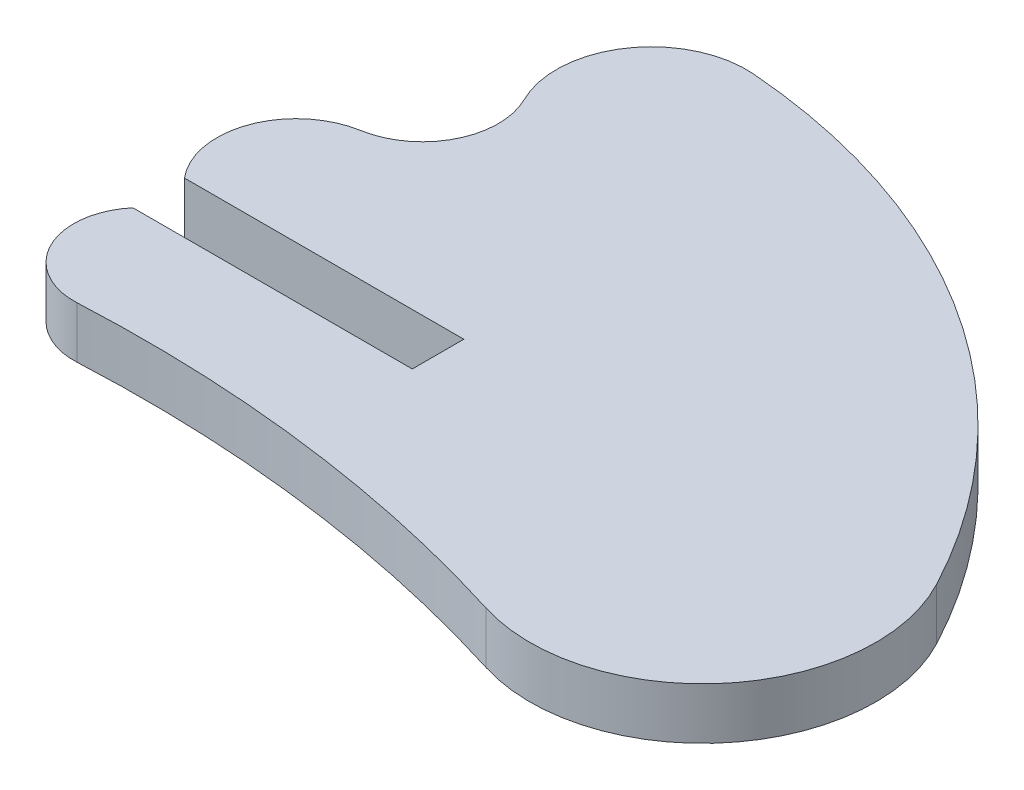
ISO-10303-21;
HEADER;
FILE_DESCRIPTION(('STEP AP214'),'2;1');
FILE_NAME('part.step','',(''),(''),'','','');
FILE_SCHEMA(('AUTOMOTIVE_DESIGN { 1 0 10303 214 1 1 1 1 }'));
ENDSEC;
DATA;
#1=APPLICATION_CONTEXT('core data for automotive mechanical design processes');
#2=APPLICATION_PROTOCOL_DEFINITION('international standard','automotive_design',2000,#1);
#3=PRODUCT_CONTEXT('',#1,'mechanical');
#4=PRODUCT('Part','Part','',(#3));
#5=PRODUCT_RELATED_PRODUCT_CATEGORY('part','',(#4));
#6=PRODUCT_DEFINITION_FORMATION('','',#4);
#7=PRODUCT_DEFINITION_CONTEXT('part definition',#1,'design');
#8=PRODUCT_DEFINITION('design','',#6,#7);
#9=PRODUCT_DEFINITION_SHAPE('','',#8);
#10=(LENGTH_UNIT() NAMED_UNIT(*) SI_UNIT(.MILLI.,.METRE.));
#11=(NAMED_UNIT(*) PLANE_ANGLE_UNIT() SI_UNIT($,.RADIAN.));
#12=(NAMED_UNIT(*) SI_UNIT($,.STERADIAN.) SOLID_ANGLE_UNIT());
#13=UNCERTAINTY_MEASURE_WITH_UNIT(LENGTH_MEASURE(1.E-05),#10,'distance_accuracy_value','');
#14=(GEOMETRIC_REPRESENTATION_CONTEXT(3) GLOBAL_UNCERTAINTY_ASSIGNED_CONTEXT((#13)) GLOBAL_UNIT_ASSIGNED_CONTEXT((#10,
#11,#12)) REPRESENTATION_CONTEXT('',''));
#15=CARTESIAN_POINT('',(0.,0.,0.));
#16=DIRECTION('',(0.,0.,1.));
#17=DIRECTION('',(1.,0.,0.));
#18=AXIS2_PLACEMENT_3D('',#15,#16,#17);
#19=CARTESIAN_POINT('',(-41817.0317918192,3.,-18208.9563791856));
#20=DIRECTION('',(0.,-1.,0.));
#21=DIRECTION('',(0.,0.,-1.));
#22=AXIS2_PLACEMENT_3D('',#19,#20,#21);
#23=CYLINDRICAL_SURFACE('',#22,10.0652598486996);
#24=CARTESIAN_POINT('',(-41817.0317918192,0.,-18208.9563791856));
#25=DIRECTION('',(0.,1.,0.));
#26=DIRECTION('',(0.,0.,1.));
#27=AXIS2_PLACEMENT_3D('',#24,#25,#26);
#28=CIRCLE('',#27,10.0652598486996);
#29=CARTESIAN_POINT('',(-41820.040166,0.,-18199.3512170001));
#30=VERTEX_POINT('',#29);
#31=CARTESIAN_POINT('',(-41808.137642,0.,-18213.668444));
#32=VERTEX_POINT('',#31);
#33=EDGE_CURVE('E144',#30,#32,#28,.T.);
#34=ORIENTED_EDGE('',*,*,#33,.T.);
#35=DIRECTION('',(0.,-1.,0.));
#36=VECTOR('',#35,1.);
#37=CARTESIAN_POINT('',(-41808.137642,3.,-18213.668444));
#38=LINE('',#37,#36);
#39=CARTESIAN_POINT('',(-41808.137642,3.,-18213.668444));
#40=VERTEX_POINT('',#39);
#41=EDGE_CURVE('E11',#40,#32,#38,.T.);
#42=ORIENTED_EDGE('',*,*,#41,.F.);
#43=CARTESIAN_POINT('',(-41817.0317918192,3.,-18208.9563791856));
#44=DIRECTION('',(0.,1.,0.));
#45=DIRECTION('',(0.,0.,1.));
#46=AXIS2_PLACEMENT_3D('',#43,#44,#45);
#47=CIRCLE('',#46,10.0652598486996);
#48=CARTESIAN_POINT('',(-41820.040166,3.,-18199.3512170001));
#49=VERTEX_POINT('',#48);
#50=EDGE_CURVE('E162',#49,#40,#47,.T.);
#51=ORIENTED_EDGE('',*,*,#50,.F.);
#52=DIRECTION('',(0.,-1.,0.));
#53=VECTOR('',#52,1.);
#54=CARTESIAN_POINT('',(-41820.040166,3.,-18199.3512170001));
#55=LINE('',#54,#53);
#56=EDGE_CURVE('E140',#49,#30,#55,.T.);
#57=ORIENTED_EDGE('',*,*,#56,.T.);
#58=EDGE_LOOP('',(#34,#42,#51,#57));
#59=FACE_BOUND('',#58,.T.);
#60=ADVANCED_FACE('F36',(#59),#23,.T.);
#61=CARTESIAN_POINT('',(-41842.1884395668,3.,-18195.6353827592));
#62=DIRECTION('',(0.,-1.,0.));
#63=DIRECTION('',(0.,0.,-1.));
#64=AXIS2_PLACEMENT_3D('',#61,#62,#63);
#65=CYLINDRICAL_SURFACE('',#64,38.5311317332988);
#66=CARTESIAN_POINT('',(-41842.1884395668,0.,-18195.6353827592));
#67=DIRECTION('',(0.,1.,0.));
#68=DIRECTION('',(0.,0.,1.));
#69=AXIS2_PLACEMENT_3D('',#66,#67,#68);
#70=CIRCLE('',#69,38.5311317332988);
#71=CARTESIAN_POINT('',(-41839.185761,0.,-18234.0493390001));
#72=VERTEX_POINT('',#71);
#73=EDGE_CURVE('E147',#32,#72,#70,.T.);
#74=ORIENTED_EDGE('',*,*,#73,.T.);
#75=DIRECTION('',(0.,-1.,0.));
#76=VECTOR('',#75,1.);
#77=CARTESIAN_POINT('',(-41839.185761,3.,-18234.0493390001));
#78=LINE('',#77,#76);
#79=CARTESIAN_POINT('',(-41839.185761,3.,-18234.0493390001));
#80=VERTEX_POINT('',#79);
#81=EDGE_CURVE('E44',#80,#72,#78,.T.);
#82=ORIENTED_EDGE('',*,*,#81,.F.);
#83=CARTESIAN_POINT('',(-41842.1884395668,3.,-18195.6353827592));
#84=DIRECTION('',(0.,1.,0.));
#85=DIRECTION('',(0.,0.,1.));
#86=AXIS2_PLACEMENT_3D('',#83,#84,#85);
#87=CIRCLE('',#86,38.5311317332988);
#88=EDGE_CURVE('E101',#40,#80,#87,.T.);
#89=ORIENTED_EDGE('',*,*,#88,.F.);
#90=ORIENTED_EDGE('',*,*,#41,.T.);
#91=EDGE_LOOP('',(#74,#82,#89,#90));
#92=FACE_BOUND('',#91,.T.);
#93=ADVANCED_FACE('F211',(#92),#65,.T.);
#94=CARTESIAN_POINT('',(-41839.6167840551,3.,-18228.5455191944));
#95=DIRECTION('',(0.,-1.,0.));
#96=DIRECTION('',(0.,0.,-1.));
#97=AXIS2_PLACEMENT_3D('',#94,#95,#96);
#98=CYLINDRICAL_SURFACE('',#97,5.52067145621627);
#99=CARTESIAN_POINT('',(-41839.6167840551,0.,-18228.5455191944));
#100=DIRECTION('',(0.,1.,0.));
#101=DIRECTION('',(0.,0.,1.));
#102=AXIS2_PLACEMENT_3D('',#99,#100,#101);
#103=CIRCLE('',#102,5.52067145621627);
#104=CARTESIAN_POINT('',(-41844.559122,0.,-18226.085619));
#105=VERTEX_POINT('',#104);
#106=EDGE_CURVE('E149',#72,#105,#103,.T.);
#107=ORIENTED_EDGE('',*,*,#106,.T.);
#108=DIRECTION('',(0.,-1.,0.));
#109=VECTOR('',#108,1.);
#110=CARTESIAN_POINT('',(-41844.559122,3.,-18226.085619));
#111=LINE('',#110,#109);
#112=CARTESIAN_POINT('',(-41844.559122,3.,-18226.085619));
#113=VERTEX_POINT('',#112);
#114=EDGE_CURVE('E175',#113,#105,#111,.T.);
#115=ORIENTED_EDGE('',*,*,#114,.F.);
#116=CARTESIAN_POINT('',(-41839.6167840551,3.,-18228.5455191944));
#117=DIRECTION('',(0.,1.,0.));
#118=DIRECTION('',(0.,0.,1.));
#119=AXIS2_PLACEMENT_3D('',#116,#117,#118);
#120=CIRCLE('',#119,5.52067145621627);
#121=EDGE_CURVE('E183',#80,#113,#120,.T.);
#122=ORIENTED_EDGE('',*,*,#121,.F.);
#123=ORIENTED_EDGE('',*,*,#81,.T.);
#124=EDGE_LOOP('',(#107,#115,#122,#123));
#125=FACE_BOUND('',#124,.T.);
#126=ADVANCED_FACE('F181',(#125),#98,.T.);
#127=CARTESIAN_POINT('',(-41848.5079255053,3.,-18224.1189168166));
#128=DIRECTION('',(0.,-1.,0.));
#129=DIRECTION('',(0.,0.,-1.));
#130=AXIS2_PLACEMENT_3D('',#127,#128,#129);
#131=CYLINDRICAL_SURFACE('',#130,4.41145855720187);
#132=CARTESIAN_POINT('',(-41848.5079255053,0.,-18224.1189168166));
#133=DIRECTION('',(0.,-1.,0.));
#134=DIRECTION('',(0.,0.,1.));
#135=AXIS2_PLACEMENT_3D('',#132,#133,#134);
#136=CIRCLE('',#135,4.41145855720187);
#137=CARTESIAN_POINT('',(-41847.755704,0.,-18219.772064));
#138=VERTEX_POINT('',#137);
#139=EDGE_CURVE('E151',#105,#138,#136,.T.);
#140=ORIENTED_EDGE('',*,*,#139,.T.);
#141=DIRECTION('',(0.,-1.,0.));
#142=VECTOR('',#141,1.);
#143=CARTESIAN_POINT('',(-41847.755704,3.,-18219.772064));
#144=LINE('',#143,#142);
#145=CARTESIAN_POINT('',(-41847.755704,3.,-18219.772064));
#146=VERTEX_POINT('',#145);
#147=EDGE_CURVE('E172',#146,#138,#144,.T.);
#148=ORIENTED_EDGE('',*,*,#147,.F.);
#149=CARTESIAN_POINT('',(-41848.5079255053,3.,-18224.1189168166));
#150=DIRECTION('',(0.,-1.,0.));
#151=DIRECTION('',(0.,0.,1.));
#152=AXIS2_PLACEMENT_3D('',#149,#150,#151);
#153=CIRCLE('',#152,4.41145855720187);
#154=EDGE_CURVE('E201',#113,#146,#153,.T.);
#155=ORIENTED_EDGE('',*,*,#154,.F.);
#156=ORIENTED_EDGE('',*,*,#114,.T.);
#157=EDGE_LOOP('',(#140,#148,#155,#156));
#158=FACE_BOUND('',#157,.T.);
#159=ADVANCED_FACE('F192',(#158),#131,.F.);
#160=CARTESIAN_POINT('',(-41846.9736069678,3.,-18215.2298035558));
#161=DIRECTION('',(0.,-1.,0.));
#162=DIRECTION('',(0.,0.,-1.));
#163=AXIS2_PLACEMENT_3D('',#160,#161,#162);
#164=CYLINDRICAL_SURFACE('',#163,4.60910031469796);
#165=CARTESIAN_POINT('',(-41846.9736069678,0.,-18215.2298035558));
#166=DIRECTION('',(0.,1.,0.));
#167=DIRECTION('',(0.,0.,1.));
#168=AXIS2_PLACEMENT_3D('',#165,#166,#167);
#169=CIRCLE('',#168,4.60910031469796);
#170=CARTESIAN_POINT('',(-41850.488281,0.,-18212.248047));
#171=VERTEX_POINT('',#170);
#172=EDGE_CURVE('E153',#138,#171,#169,.T.);
#173=ORIENTED_EDGE('',*,*,#172,.T.);
#174=DIRECTION('',(0.,-1.,0.));
#175=VECTOR('',#174,1.);
#176=CARTESIAN_POINT('',(-41850.488281,3.,-18212.248047));
#177=LINE('',#176,#175);
#178=CARTESIAN_POINT('',(-41850.488281,3.,-18212.248047));
#179=VERTEX_POINT('',#178);
#180=EDGE_CURVE('E169',#179,#171,#177,.T.);
#181=ORIENTED_EDGE('',*,*,#180,.F.);
#182=CARTESIAN_POINT('',(-41846.9736069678,3.,-18215.2298035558));
#183=DIRECTION('',(0.,1.,0.));
#184=DIRECTION('',(0.,0.,1.));
#185=AXIS2_PLACEMENT_3D('',#182,#183,#184);
#186=CIRCLE('',#185,4.60910031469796);
#187=EDGE_CURVE('E198',#146,#179,#186,.T.);
#188=ORIENTED_EDGE('',*,*,#187,.F.);
#189=ORIENTED_EDGE('',*,*,#147,.T.);
#190=EDGE_LOOP('',(#173,#181,#188,#189));
#191=FACE_BOUND('',#190,.T.);
#192=ADVANCED_FACE('F196',(#191),#164,.T.);
#193=CARTESIAN_POINT('',(-41834.238281,3.,-18212.251953));
#194=DIRECTION('',(-0.00024036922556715,0.,-0.999999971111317));
#195=DIRECTION('',(-0.999999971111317,0.,0.00024036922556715));
#196=AXIS2_PLACEMENT_3D('',#193,#194,#195);
#197=PLANE('',#196);
#198=DIRECTION('',(0.999999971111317,0.,-0.000240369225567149));
#199=VECTOR('',#198,1.);
#200=CARTESIAN_POINT('',(-41834.238281,0.,-18212.251953));
#201=LINE('',#200,#199);
#202=CARTESIAN_POINT('',(-41834.238281,0.,-18212.251953));
#203=VERTEX_POINT('',#202);
#204=EDGE_CURVE('E155',#171,#203,#201,.T.);
#205=ORIENTED_EDGE('',*,*,#204,.T.);
#206=DIRECTION('',(0.,-1.,0.));
#207=VECTOR('',#206,1.);
#208=CARTESIAN_POINT('',(-41834.238281,3.,-18212.251953));
#209=LINE('',#208,#207);
#210=CARTESIAN_POINT('',(-41834.238281,3.,-18212.251953));
#211=VERTEX_POINT('',#210);
#212=EDGE_CURVE('E166',#211,#203,#209,.T.);
#213=ORIENTED_EDGE('',*,*,#212,.F.);
#214=DIRECTION('',(0.999999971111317,0.,-0.000240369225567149));
#215=VECTOR('',#214,1.);
#216=CARTESIAN_POINT('',(-41834.238281,3.,-18212.251953));
#217=LINE('',#216,#215);
#218=EDGE_CURVE('E200',#179,#211,#217,.T.);
#219=ORIENTED_EDGE('',*,*,#218,.F.);
#220=ORIENTED_EDGE('',*,*,#180,.T.);
#221=EDGE_LOOP('',(#205,#213,#219,#220));
#222=FACE_BOUND('',#221,.T.);
#223=ADVANCED_FACE('F223',(#222),#197,.F.);
#224=CARTESIAN_POINT('',(-41834.238281,3.,-18209.253906));
#225=DIRECTION('',(1.,0.,0.));
#226=DIRECTION('',(0.,0.,-1.));
#227=AXIS2_PLACEMENT_3D('',#224,#225,#226);
#228=PLANE('',#227);
#229=DIRECTION('',(0.,0.,1.));
#230=VECTOR('',#229,1.);
#231=CARTESIAN_POINT('',(-41834.238281,0.,-18209.253906));
#232=LINE('',#231,#230);
#233=CARTESIAN_POINT('',(-41834.238281,0.,-18209.253906));
#234=VERTEX_POINT('',#233);
#235=EDGE_CURVE('E157',#203,#234,#232,.T.);
#236=ORIENTED_EDGE('',*,*,#235,.T.);
#237=DIRECTION('',(0.,-1.,0.));
#238=VECTOR('',#237,1.);
#239=CARTESIAN_POINT('',(-41834.238281,3.,-18209.253906));
#240=LINE('',#239,#238);
#241=CARTESIAN_POINT('',(-41834.238281,3.,-18209.253906));
#242=VERTEX_POINT('',#241);
#243=EDGE_CURVE('E135',#242,#234,#240,.T.);
#244=ORIENTED_EDGE('',*,*,#243,.F.);
#245=DIRECTION('',(0.,0.,1.));
#246=VECTOR('',#245,1.);
#247=CARTESIAN_POINT('',(-41834.238281,3.,-18209.253906));
#248=LINE('',#247,#246);
#249=EDGE_CURVE('E126',#211,#242,#248,.T.);
#250=ORIENTED_EDGE('',*,*,#249,.F.);
#251=ORIENTED_EDGE('',*,*,#212,.T.);
#252=EDGE_LOOP('',(#236,#244,#250,#251));
#253=FACE_BOUND('',#252,.T.);
#254=ADVANCED_FACE('F226',(#253),#228,.F.);
#255=CARTESIAN_POINT('',(-41850.486809,3.,-18209.248787));
#256=DIRECTION('',(0.000315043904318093,0.,0.999999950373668));
#257=DIRECTION('',(0.999999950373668,0.,-0.000315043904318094));
#258=AXIS2_PLACEMENT_3D('',#255,#256,#257);
#259=PLANE('',#258);
#260=DIRECTION('',(-0.999999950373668,0.,0.000315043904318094));
#261=VECTOR('',#260,1.);
#262=CARTESIAN_POINT('',(-41850.486809,0.,-18209.248787));
#263=LINE('',#262,#261);
#264=CARTESIAN_POINT('',(-41850.486809,0.,-18209.248787));
#265=VERTEX_POINT('',#264);
#266=EDGE_CURVE('E134',#234,#265,#263,.T.);
#267=ORIENTED_EDGE('',*,*,#266,.T.);
#268=DIRECTION('',(0.,-1.,0.));
#269=VECTOR('',#268,1.);
#270=CARTESIAN_POINT('',(-41850.486809,3.,-18209.248787));
#271=LINE('',#270,#269);
#272=CARTESIAN_POINT('',(-41850.486809,3.,-18209.248787));
#273=VERTEX_POINT('',#272);
#274=EDGE_CURVE('E131',#273,#265,#271,.T.);
#275=ORIENTED_EDGE('',*,*,#274,.F.);
#276=DIRECTION('',(-0.999999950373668,0.,0.000315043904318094));
#277=VECTOR('',#276,1.);
#278=CARTESIAN_POINT('',(-41850.486809,3.,-18209.248787));
#279=LINE('',#278,#277);
#280=EDGE_CURVE('E120',#242,#273,#279,.T.);
#281=ORIENTED_EDGE('',*,*,#280,.F.);
#282=ORIENTED_EDGE('',*,*,#243,.T.);
#283=EDGE_LOOP('',(#267,#275,#281,#282));
#284=FACE_BOUND('',#283,.T.);
#285=ADVANCED_FACE('F132',(#284),#259,.F.);
#286=CARTESIAN_POINT('',(-41847.5194658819,3.,-18206.7264299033));
#287=DIRECTION('',(0.,-1.,0.));
#288=DIRECTION('',(0.,0.,-1.));
#289=AXIS2_PLACEMENT_3D('',#286,#287,#288);
#290=CYLINDRICAL_SURFACE('',#289,3.89453598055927);
#291=CARTESIAN_POINT('',(-41847.5194658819,0.,-18206.7264299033));
#292=DIRECTION('',(0.,1.,0.));
#293=DIRECTION('',(0.,0.,1.));
#294=AXIS2_PLACEMENT_3D('',#291,#292,#293);
#295=CIRCLE('',#294,3.89453598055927);
#296=CARTESIAN_POINT('',(-41847.325924,0.,-18202.8367060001));
#297=VERTEX_POINT('',#296);
#298=EDGE_CURVE('E87',#265,#297,#295,.T.);
#299=ORIENTED_EDGE('',*,*,#298,.T.);
#300=DIRECTION('',(0.,-1.,0.));
#301=VECTOR('',#300,1.);
#302=CARTESIAN_POINT('',(-41847.325924,3.,-18202.8367060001));
#303=LINE('',#302,#301);
#304=CARTESIAN_POINT('',(-41847.325924,3.,-18202.8367060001));
#305=VERTEX_POINT('',#304);
#306=EDGE_CURVE('E136',#305,#297,#303,.T.);
#307=ORIENTED_EDGE('',*,*,#306,.F.);
#308=CARTESIAN_POINT('',(-41847.5194658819,3.,-18206.7264299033));
#309=DIRECTION('',(0.,1.,0.));
#310=DIRECTION('',(0.,0.,1.));
#311=AXIS2_PLACEMENT_3D('',#308,#309,#310);
#312=CIRCLE('',#311,3.89453598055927);
#313=EDGE_CURVE('E124',#273,#305,#312,.T.);
#314=ORIENTED_EDGE('',*,*,#313,.F.);
#315=ORIENTED_EDGE('',*,*,#274,.T.);
#316=EDGE_LOOP('',(#299,#307,#314,#315));
#317=FACE_BOUND('',#316,.T.);
#318=ADVANCED_FACE('F138',(#317),#290,.T.);
#319=CARTESIAN_POINT('',(-41843.460937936,3.,-18124.5488281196));
#320=DIRECTION('',(0.,-1.,0.));
#321=DIRECTION('',(0.,0.,-1.));
#322=AXIS2_PLACEMENT_3D('',#319,#320,#321);
#323=CYLINDRICAL_SURFACE('',#322,78.3832248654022);
#324=CARTESIAN_POINT('',(-41843.460937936,0.,-18124.5488281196));
#325=DIRECTION('',(0.,-1.,0.));
#326=DIRECTION('',(0.,0.,1.));
#327=AXIS2_PLACEMENT_3D('',#324,#325,#326);
#328=CIRCLE('',#327,78.3832248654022);
#329=EDGE_CURVE('E93',#297,#30,#328,.T.);
#330=ORIENTED_EDGE('',*,*,#329,.T.);
#331=ORIENTED_EDGE('',*,*,#56,.F.);
#332=CARTESIAN_POINT('',(-41843.460937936,3.,-18124.5488281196));
#333=DIRECTION('',(0.,-1.,0.));
#334=DIRECTION('',(0.,0.,1.));
#335=AXIS2_PLACEMENT_3D('',#332,#333,#334);
#336=CIRCLE('',#335,78.3832248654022);
#337=EDGE_CURVE('E52',#305,#49,#336,.T.);
#338=ORIENTED_EDGE('',*,*,#337,.F.);
#339=ORIENTED_EDGE('',*,*,#306,.T.);
#340=EDGE_LOOP('',(#330,#331,#338,#339));
#341=FACE_BOUND('',#340,.T.);
#342=ADVANCED_FACE('F235',(#341),#323,.F.);
#343=CARTESIAN_POINT('',(-41817.0317918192,3.,-18208.9563791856));
#344=DIRECTION('',(0.,1.,0.));
#345=DIRECTION('',(0.,0.,1.));
#346=AXIS2_PLACEMENT_3D('',#343,#344,#345);
#347=PLANE('',#346);
#348=ORIENTED_EDGE('',*,*,#50,.T.);
#349=ORIENTED_EDGE('',*,*,#88,.T.);
#350=ORIENTED_EDGE('',*,*,#121,.T.);
#351=ORIENTED_EDGE('',*,*,#154,.T.);
#352=ORIENTED_EDGE('',*,*,#187,.T.);
#353=ORIENTED_EDGE('',*,*,#218,.T.);
#354=ORIENTED_EDGE('',*,*,#249,.T.);
#355=ORIENTED_EDGE('',*,*,#280,.T.);
#356=ORIENTED_EDGE('',*,*,#313,.T.);
#357=ORIENTED_EDGE('',*,*,#337,.T.);
#358=EDGE_LOOP('',(#348,#349,#350,#351,#352,#353,#354,#355,#356,#357));
#359=FACE_BOUND('',#358,.T.);
#360=ADVANCED_FACE('F122',(#359),#347,.T.);
#361=CARTESIAN_POINT('',(-41817.0317918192,0.,-18208.9563791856));
#362=DIRECTION('',(0.,1.,0.));
#363=DIRECTION('',(0.,0.,1.));
#364=AXIS2_PLACEMENT_3D('',#361,#362,#363);
#365=PLANE('',#364);
#366=ORIENTED_EDGE('',*,*,#33,.F.);
#367=ORIENTED_EDGE('',*,*,#329,.F.);
#368=ORIENTED_EDGE('',*,*,#298,.F.);
#369=ORIENTED_EDGE('',*,*,#266,.F.);
#370=ORIENTED_EDGE('',*,*,#235,.F.);
#371=ORIENTED_EDGE('',*,*,#204,.F.);
#372=ORIENTED_EDGE('',*,*,#172,.F.);
#373=ORIENTED_EDGE('',*,*,#139,.F.);
#374=ORIENTED_EDGE('',*,*,#106,.F.);
#375=ORIENTED_EDGE('',*,*,#73,.F.);
#376=EDGE_LOOP('',(#366,#367,#368,#369,#370,#371,#372,#373,#374,#375));
#377=FACE_BOUND('',#376,.T.);
#378=ADVANCED_FACE('F187',(#377),#365,.F.);
#379=CLOSED_SHELL('',(#60,#93,#126,#159,#192,#223,#254,#285,#318,#342,#360,#378));
#380=MANIFOLD_SOLID_BREP('B2',#379);
#381=ADVANCED_BREP_SHAPE_REPRESENTATION('',(#18,#380),#14);
#382=SHAPE_DEFINITION_REPRESENTATION(#9,#381);
ENDSEC;
END-ISO-10303-21;
